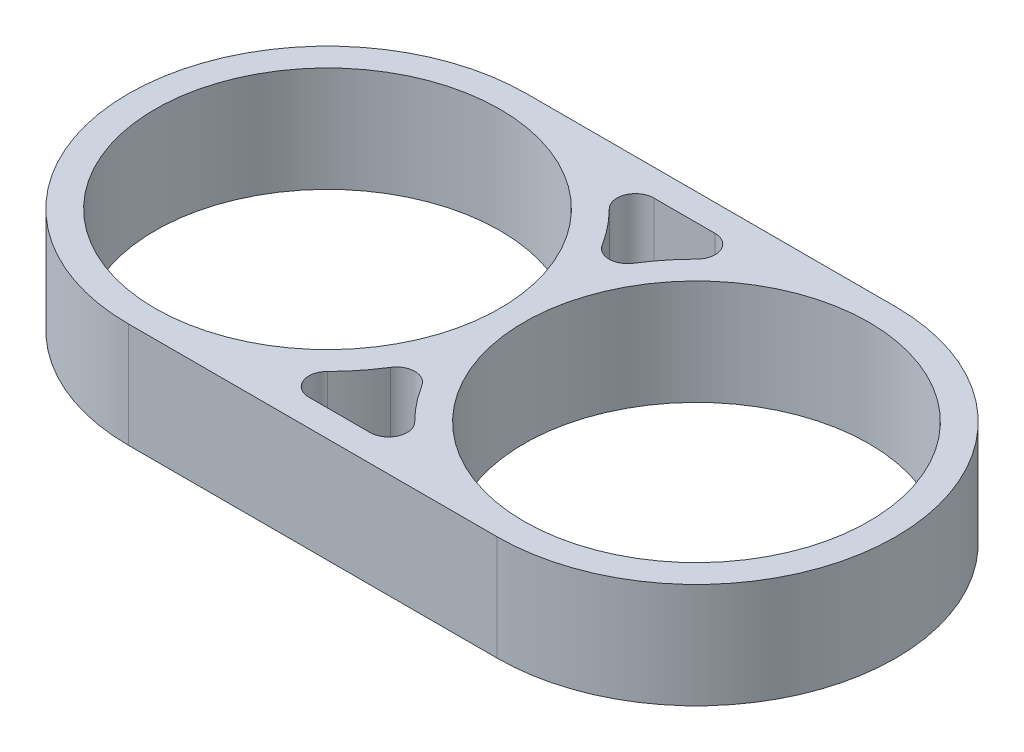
from build123d import *

# Parameters (mm, degrees)
SKIZZE1_R                       = 9.35
AUFSATZ_LINEAR_AUSTRAGEN1_DEPTH = 5.7


with BuildPart() as part:
    # Skizze1 → Aufsatz-Linear austragen1 (new body)
    with BuildSketch(Plane(origin=(0, 0, 0), x_dir=(1, 0, 0), z_dir=(0, 1, 0))):
        with BuildLine():
            Line((-10, 10.8), (10, 10.8))
            ThreePointArc((10, 10.8), (20.8, 0), (10, -10.8))
            Line((10, -10.8), (-10, -10.8))
            ThreePointArc((-10, -10.8), (-20.8, 0), (-10, 10.8))
        make_face()
        with Locations(Location((-10, 0, 0), (0, 0, 270))):
            Circle(SKIZZE1_R, mode=Mode.SUBTRACT)
        with Locations(Location((10, 0, 0), (0, 0, 270))):
            Circle(SKIZZE1_R, mode=Mode.SUBTRACT)
        with BuildLine():
            Line((1.662284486, 9.35), (-1.662284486, 9.35))
            ThreePointArc((-1.662284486, 9.35), (-2.58630481, 8.732343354), (-2.368870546, 7.642372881))
            ThreePointArc((-2.368870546, 7.642372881), (-1.554052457, 6.730970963), (-0.847457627, 5.733320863))
            ThreePointArc((-0.847457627, 5.733320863), (0, 5.264183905), (0.847457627, 5.733320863))
            ThreePointArc((0.847457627, 5.733320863), (1.554052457, 6.730970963), (2.368870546, 7.642372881))
            ThreePointArc((2.368870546, 7.642372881), (2.58630481, 8.732343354), (1.662284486, 9.35))
        make_face(mode=Mode.SUBTRACT)
        with BuildLine():
            Line((-1.662284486, -9.35), (1.662284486, -9.35))
            ThreePointArc((1.662284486, -9.35), (2.58630481, -8.732343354), (2.368870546, -7.642372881))
            ThreePointArc((2.368870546, -7.642372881), (1.554052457, -6.730970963), (0.847457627, -5.733320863))
            ThreePointArc((0.847457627, -5.733320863), (0, -5.264183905), (-0.847457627, -5.733320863))
            ThreePointArc((-0.847457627, -5.733320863), (-1.554052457, -6.730970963), (-2.368870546, -7.642372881))
            ThreePointArc((-2.368870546, -7.642372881), (-2.58630481, -8.732343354), (-1.662284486, -9.35))
        make_face(mode=Mode.SUBTRACT)
    extrude(amount=AUFSATZ_LINEAR_AUSTRAGEN1_DEPTH)


solid = part.part
